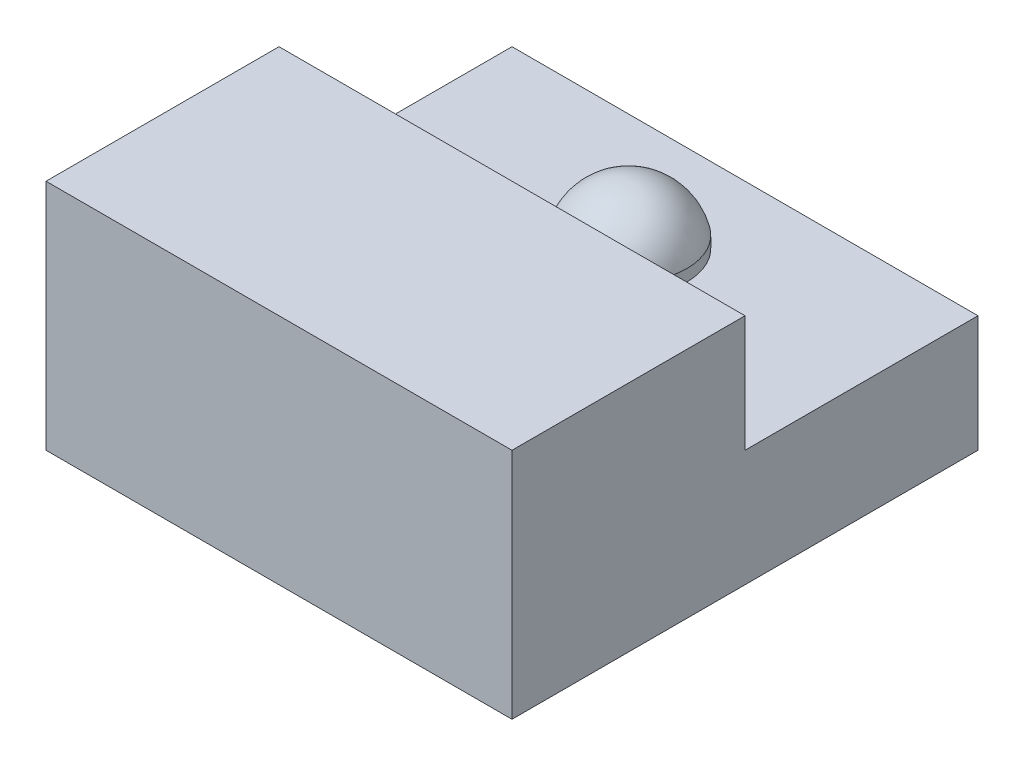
ISO-10303-21;
HEADER;
FILE_DESCRIPTION(('STEP AP214'),'2;1');
FILE_NAME('part.step','',(''),(''),'','','');
FILE_SCHEMA(('AUTOMOTIVE_DESIGN { 1 0 10303 214 1 1 1 1 }'));
ENDSEC;
DATA;
#1=APPLICATION_CONTEXT('core data for automotive mechanical design processes');
#2=APPLICATION_PROTOCOL_DEFINITION('international standard','automotive_design',2000,#1);
#3=PRODUCT_CONTEXT('',#1,'mechanical');
#4=PRODUCT('Part','Part','',(#3));
#5=PRODUCT_RELATED_PRODUCT_CATEGORY('part','',(#4));
#6=PRODUCT_DEFINITION_FORMATION('','',#4);
#7=PRODUCT_DEFINITION_CONTEXT('part definition',#1,'design');
#8=PRODUCT_DEFINITION('design','',#6,#7);
#9=PRODUCT_DEFINITION_SHAPE('','',#8);
#10=(LENGTH_UNIT() NAMED_UNIT(*) SI_UNIT(.MILLI.,.METRE.));
#11=(NAMED_UNIT(*) PLANE_ANGLE_UNIT() SI_UNIT($,.RADIAN.));
#12=(NAMED_UNIT(*) SI_UNIT($,.STERADIAN.) SOLID_ANGLE_UNIT());
#13=UNCERTAINTY_MEASURE_WITH_UNIT(LENGTH_MEASURE(1.E-05),#10,'distance_accuracy_value','');
#14=(GEOMETRIC_REPRESENTATION_CONTEXT(3) GLOBAL_UNCERTAINTY_ASSIGNED_CONTEXT((#13)) GLOBAL_UNIT_ASSIGNED_CONTEXT((#10,
#11,#12)) REPRESENTATION_CONTEXT('',''));
#15=CARTESIAN_POINT('',(0.,0.,0.));
#16=DIRECTION('',(0.,0.,1.));
#17=DIRECTION('',(1.,0.,0.));
#18=AXIS2_PLACEMENT_3D('',#15,#16,#17);
#19=CARTESIAN_POINT('',(-2.00000000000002,0.499999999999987,2.));
#20=DIRECTION('',(0.,-0.999999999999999,0.));
#21=DIRECTION('',(0.,0.,-1.));
#22=AXIS2_PLACEMENT_3D('',#19,#20,#21);
#23=PLANE('',#22);
#24=DIRECTION('',(-1.,0.,0.));
#25=VECTOR('',#24,1.);
#26=CARTESIAN_POINT('',(-2.,0.499999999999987,0.));
#27=LINE('',#26,#25);
#28=CARTESIAN_POINT('',(2.,0.499999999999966,0.));
#29=VERTEX_POINT('',#28);
#30=CARTESIAN_POINT('',(-2.,0.499999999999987,0.));
#31=VERTEX_POINT('',#30);
#32=EDGE_CURVE('E46',#29,#31,#27,.T.);
#33=ORIENTED_EDGE('',*,*,#32,.F.);
#34=DIRECTION('',(0.,0.,-1.));
#35=VECTOR('',#34,1.);
#36=CARTESIAN_POINT('',(1.99999999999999,0.499999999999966,2.));
#37=LINE('',#36,#35);
#38=CARTESIAN_POINT('',(2.,0.5,-2.));
#39=VERTEX_POINT('',#38);
#40=EDGE_CURVE('E90',#29,#39,#37,.T.);
#41=ORIENTED_EDGE('',*,*,#40,.T.);
#42=DIRECTION('',(-1.,0.,0.));
#43=VECTOR('',#42,1.);
#44=CARTESIAN_POINT('',(-2.,0.499999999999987,-2.));
#45=LINE('',#44,#43);
#46=CARTESIAN_POINT('',(-2.,0.499999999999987,-2.));
#47=VERTEX_POINT('',#46);
#48=EDGE_CURVE('E85',#39,#47,#45,.T.);
#49=ORIENTED_EDGE('',*,*,#48,.T.);
#50=DIRECTION('',(0.,0.,-1.));
#51=VECTOR('',#50,1.);
#52=CARTESIAN_POINT('',(-2.00000000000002,0.499999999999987,2.));
#53=LINE('',#52,#51);
#54=EDGE_CURVE('E82',#31,#47,#53,.T.);
#55=ORIENTED_EDGE('',*,*,#54,.F.);
#56=EDGE_LOOP('',(#33,#41,#49,#55));
#57=FACE_BOUND('',#56,.T.);
#58=CARTESIAN_POINT('',(0.,0.5,-1.));
#59=DIRECTION('',(0.,-0.999999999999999,0.));
#60=DIRECTION('',(0.,0.,-1.));
#61=AXIS2_PLACEMENT_3D('',#58,#59,#60);
#62=CIRCLE('',#61,0.5);
#63=CARTESIAN_POINT('',(0.,0.500000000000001,-1.5));
#64=VERTEX_POINT('',#63);
#65=EDGE_CURVE('E11',#64,#64,#62,.F.);
#66=ORIENTED_EDGE('',*,*,#65,.F.);
#67=EDGE_LOOP('',(#66));
#68=FACE_BOUND('',#67,.T.);
#69=ADVANCED_FACE('F31',(#57,#68),#23,.F.);
#70=CARTESIAN_POINT('',(-2.00000000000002,0.499999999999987,2.));
#71=DIRECTION('',(1.,0.,0.));
#72=DIRECTION('',(0.,0.,-1.));
#73=AXIS2_PLACEMENT_3D('',#70,#71,#72);
#74=PLANE('',#73);
#75=DIRECTION('',(0.,-0.999999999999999,0.));
#76=VECTOR('',#75,1.);
#77=CARTESIAN_POINT('',(-2.,0.499999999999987,-2.));
#78=LINE('',#77,#76);
#79=CARTESIAN_POINT('',(-2.,-0.500000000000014,-2.));
#80=VERTEX_POINT('',#79);
#81=EDGE_CURVE('E109',#47,#80,#78,.T.);
#82=ORIENTED_EDGE('',*,*,#81,.T.);
#83=DIRECTION('',(0.,0.,-1.));
#84=VECTOR('',#83,1.);
#85=CARTESIAN_POINT('',(-2.00000000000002,-0.500000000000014,2.));
#86=LINE('',#85,#84);
#87=CARTESIAN_POINT('',(-2.00000000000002,-0.500000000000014,2.));
#88=VERTEX_POINT('',#87);
#89=EDGE_CURVE('E39',#88,#80,#86,.T.);
#90=ORIENTED_EDGE('',*,*,#89,.F.);
#91=DIRECTION('',(0.,-0.999999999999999,0.));
#92=VECTOR('',#91,1.);
#93=CARTESIAN_POINT('',(-2.00000000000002,0.499999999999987,2.));
#94=LINE('',#93,#92);
#95=CARTESIAN_POINT('',(-2.00000000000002,1.49999999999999,2.));
#96=VERTEX_POINT('',#95);
#97=EDGE_CURVE('E134',#96,#88,#94,.T.);
#98=ORIENTED_EDGE('',*,*,#97,.F.);
#99=DIRECTION('',(0.,0.,1.));
#100=VECTOR('',#99,1.);
#101=CARTESIAN_POINT('',(-2.00000000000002,1.49999999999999,2.));
#102=LINE('',#101,#100);
#103=CARTESIAN_POINT('',(-2.,1.49999999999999,0.));
#104=VERTEX_POINT('',#103);
#105=EDGE_CURVE('E102',#104,#96,#102,.T.);
#106=ORIENTED_EDGE('',*,*,#105,.F.);
#107=DIRECTION('',(0.,-0.999999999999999,0.));
#108=VECTOR('',#107,1.);
#109=CARTESIAN_POINT('',(-2.,1.49999999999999,0.));
#110=LINE('',#109,#108);
#111=EDGE_CURVE('E98',#104,#31,#110,.T.);
#112=ORIENTED_EDGE('',*,*,#111,.T.);
#113=ORIENTED_EDGE('',*,*,#54,.T.);
#114=EDGE_LOOP('',(#82,#90,#98,#106,#112,#113));
#115=FACE_BOUND('',#114,.T.);
#116=ADVANCED_FACE('F105',(#115),#74,.F.);
#117=CARTESIAN_POINT('',(-2.00000000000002,-0.500000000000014,2.));
#118=DIRECTION('',(0.,0.999999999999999,0.));
#119=DIRECTION('',(0.,0.,1.));
#120=AXIS2_PLACEMENT_3D('',#117,#118,#119);
#121=PLANE('',#120);
#122=DIRECTION('',(1.,0.,0.));
#123=VECTOR('',#122,1.);
#124=CARTESIAN_POINT('',(-2.,-0.500000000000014,-2.));
#125=LINE('',#124,#123);
#126=CARTESIAN_POINT('',(2.,-0.5,-2.));
#127=VERTEX_POINT('',#126);
#128=EDGE_CURVE('E128',#80,#127,#125,.T.);
#129=ORIENTED_EDGE('',*,*,#128,.T.);
#130=DIRECTION('',(0.,0.,-1.));
#131=VECTOR('',#130,1.);
#132=CARTESIAN_POINT('',(1.99999999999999,-0.500000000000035,2.));
#133=LINE('',#132,#131);
#134=CARTESIAN_POINT('',(1.99999999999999,-0.500000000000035,2.));
#135=VERTEX_POINT('',#134);
#136=EDGE_CURVE('E143',#135,#127,#133,.T.);
#137=ORIENTED_EDGE('',*,*,#136,.F.);
#138=DIRECTION('',(1.,0.,0.));
#139=VECTOR('',#138,1.);
#140=CARTESIAN_POINT('',(-2.00000000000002,-0.500000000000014,2.));
#141=LINE('',#140,#139);
#142=EDGE_CURVE('E54',#88,#135,#141,.T.);
#143=ORIENTED_EDGE('',*,*,#142,.F.);
#144=ORIENTED_EDGE('',*,*,#89,.T.);
#145=EDGE_LOOP('',(#129,#137,#143,#144));
#146=FACE_BOUND('',#145,.T.);
#147=ADVANCED_FACE('F154',(#146),#121,.F.);
#148=CARTESIAN_POINT('',(1.99999999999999,0.499999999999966,2.));
#149=DIRECTION('',(-1.,0.,0.));
#150=DIRECTION('',(0.,0.,1.));
#151=AXIS2_PLACEMENT_3D('',#148,#149,#150);
#152=PLANE('',#151);
#153=DIRECTION('',(0.,0.999999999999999,0.));
#154=VECTOR('',#153,1.);
#155=CARTESIAN_POINT('',(2.,0.5,-2.));
#156=LINE('',#155,#154);
#157=EDGE_CURVE('E130',#127,#39,#156,.T.);
#158=ORIENTED_EDGE('',*,*,#157,.T.);
#159=ORIENTED_EDGE('',*,*,#40,.F.);
#160=DIRECTION('',(0.,-0.999999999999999,0.));
#161=VECTOR('',#160,1.);
#162=CARTESIAN_POINT('',(2.,1.49999999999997,0.));
#163=LINE('',#162,#161);
#164=CARTESIAN_POINT('',(2.,1.49999999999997,0.));
#165=VERTEX_POINT('',#164);
#166=EDGE_CURVE('E101',#165,#29,#163,.T.);
#167=ORIENTED_EDGE('',*,*,#166,.F.);
#168=DIRECTION('',(0.,0.,-1.));
#169=VECTOR('',#168,1.);
#170=CARTESIAN_POINT('',(2.,1.49999999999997,1.99999999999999));
#171=LINE('',#170,#169);
#172=CARTESIAN_POINT('',(2.,1.49999999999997,1.99999999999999));
#173=VERTEX_POINT('',#172);
#174=EDGE_CURVE('E111',#173,#165,#171,.T.);
#175=ORIENTED_EDGE('',*,*,#174,.F.);
#176=DIRECTION('',(0.,0.999999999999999,0.));
#177=VECTOR('',#176,1.);
#178=CARTESIAN_POINT('',(1.99999999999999,0.499999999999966,2.));
#179=LINE('',#178,#177);
#180=EDGE_CURVE('E91',#135,#173,#179,.T.);
#181=ORIENTED_EDGE('',*,*,#180,.F.);
#182=ORIENTED_EDGE('',*,*,#136,.T.);
#183=EDGE_LOOP('',(#158,#159,#167,#175,#181,#182));
#184=FACE_BOUND('',#183,.T.);
#185=ADVANCED_FACE('F148',(#184),#152,.F.);
#186=CARTESIAN_POINT('',(-2.00000000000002,-0.500000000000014,2.));
#187=DIRECTION('',(0.,0.,1.));
#188=DIRECTION('',(1.,0.,0.));
#189=AXIS2_PLACEMENT_3D('',#186,#187,#188);
#190=PLANE('',#189);
#191=ORIENTED_EDGE('',*,*,#97,.T.);
#192=ORIENTED_EDGE('',*,*,#142,.T.);
#193=ORIENTED_EDGE('',*,*,#180,.T.);
#194=DIRECTION('',(1.,0.,0.));
#195=VECTOR('',#194,1.);
#196=CARTESIAN_POINT('',(-2.00000000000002,1.49999999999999,2.));
#197=LINE('',#196,#195);
#198=EDGE_CURVE('E123',#96,#173,#197,.T.);
#199=ORIENTED_EDGE('',*,*,#198,.F.);
#200=EDGE_LOOP('',(#191,#192,#193,#199));
#201=FACE_BOUND('',#200,.T.);
#202=ADVANCED_FACE('F155',(#201),#190,.T.);
#203=CARTESIAN_POINT('',(-2.,-0.500000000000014,-2.));
#204=DIRECTION('',(0.,0.,1.));
#205=DIRECTION('',(1.,0.,0.));
#206=AXIS2_PLACEMENT_3D('',#203,#204,#205);
#207=PLANE('',#206);
#208=ORIENTED_EDGE('',*,*,#81,.F.);
#209=ORIENTED_EDGE('',*,*,#48,.F.);
#210=ORIENTED_EDGE('',*,*,#157,.F.);
#211=ORIENTED_EDGE('',*,*,#128,.F.);
#212=EDGE_LOOP('',(#208,#209,#210,#211));
#213=FACE_BOUND('',#212,.T.);
#214=ADVANCED_FACE('F150',(#213),#207,.F.);
#215=CARTESIAN_POINT('',(-2.,1.49999999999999,0.));
#216=DIRECTION('',(0.,0.,1.));
#217=DIRECTION('',(1.,0.,0.));
#218=AXIS2_PLACEMENT_3D('',#215,#216,#217);
#219=PLANE('',#218);
#220=ORIENTED_EDGE('',*,*,#32,.T.);
#221=ORIENTED_EDGE('',*,*,#111,.F.);
#222=DIRECTION('',(-1.,0.,0.));
#223=VECTOR('',#222,1.);
#224=CARTESIAN_POINT('',(-2.,1.49999999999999,0.));
#225=LINE('',#224,#223);
#226=EDGE_CURVE('E107',#165,#104,#225,.T.);
#227=ORIENTED_EDGE('',*,*,#226,.F.);
#228=ORIENTED_EDGE('',*,*,#166,.T.);
#229=EDGE_LOOP('',(#220,#221,#227,#228));
#230=FACE_BOUND('',#229,.T.);
#231=ADVANCED_FACE('F96',(#230),#219,.F.);
#232=CARTESIAN_POINT('',(-2.00000000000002,1.49999999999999,2.));
#233=DIRECTION('',(0.,-0.999999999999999,0.));
#234=DIRECTION('',(0.,0.,-1.));
#235=AXIS2_PLACEMENT_3D('',#232,#233,#234);
#236=PLANE('',#235);
#237=ORIENTED_EDGE('',*,*,#105,.T.);
#238=ORIENTED_EDGE('',*,*,#198,.T.);
#239=ORIENTED_EDGE('',*,*,#174,.T.);
#240=ORIENTED_EDGE('',*,*,#226,.T.);
#241=EDGE_LOOP('',(#237,#238,#239,#240));
#242=FACE_BOUND('',#241,.T.);
#243=ADVANCED_FACE('F158',(#242),#236,.F.);
#244=CARTESIAN_POINT('',(0.,0.599999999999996,-1.));
#245=DIRECTION('',(0.,-0.999999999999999,0.));
#246=DIRECTION('',(0.,0.,-1.));
#247=AXIS2_PLACEMENT_3D('',#244,#245,#246);
#248=CYLINDRICAL_SURFACE('',#247,0.5);
#249=CARTESIAN_POINT('',(0.,0.599999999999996,-1.));
#250=DIRECTION('',(0.,0.999999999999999,0.));
#251=DIRECTION('',(0.,0.,1.));
#252=AXIS2_PLACEMENT_3D('',#249,#250,#251);
#253=CIRCLE('',#252,0.5);
#254=CARTESIAN_POINT('',(0.,0.599999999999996,-1.5));
#255=VERTEX_POINT('',#254);
#256=EDGE_CURVE('E103',#255,#255,#253,.T.);
#257=CARTESIAN_POINT('',(0.,0.599999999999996,-1.5));
#258=CARTESIAN_POINT('',(0.,0.59895833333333,-1.5));
#259=CARTESIAN_POINT('',(0.,0.597916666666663,-1.5));
#260=CARTESIAN_POINT('',(0.,0.59583333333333,-1.5));
#261=CARTESIAN_POINT('',(0.,0.594791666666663,-1.5));
#262=CARTESIAN_POINT('',(0.,0.59270833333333,-1.5));
#263=CARTESIAN_POINT('',(0.,0.591666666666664,-1.5));
#264=CARTESIAN_POINT('',(0.,0.58958333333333,-1.5));
#265=CARTESIAN_POINT('',(0.,0.588541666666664,-1.5));
#266=CARTESIAN_POINT('',(0.,0.58645833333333,-1.5));
#267=CARTESIAN_POINT('',(0.,0.585416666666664,-1.5));
#268=CARTESIAN_POINT('',(0.,0.58333333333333,-1.5));
#269=CARTESIAN_POINT('',(0.,0.582291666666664,-1.5));
#270=CARTESIAN_POINT('',(0.,0.580208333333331,-1.5));
#271=CARTESIAN_POINT('',(0.,0.579166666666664,-1.5));
#272=CARTESIAN_POINT('',(0.,0.577083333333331,-1.5));
#273=CARTESIAN_POINT('',(0.,0.576041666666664,-1.5));
#274=CARTESIAN_POINT('',(0.,0.573958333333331,-1.5));
#275=CARTESIAN_POINT('',(0.,0.572916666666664,-1.5));
#276=CARTESIAN_POINT('',(0.,0.570833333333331,-1.5));
#277=CARTESIAN_POINT('',(0.,0.569791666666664,-1.5));
#278=CARTESIAN_POINT('',(0.,0.567708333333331,-1.5));
#279=CARTESIAN_POINT('',(0.,0.566666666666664,-1.5));
#280=CARTESIAN_POINT('',(0.,0.564583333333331,-1.5));
#281=CARTESIAN_POINT('',(0.,0.563541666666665,-1.5));
#282=CARTESIAN_POINT('',(0.,0.561458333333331,-1.5));
#283=CARTESIAN_POINT('',(0.,0.560416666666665,-1.5));
#284=CARTESIAN_POINT('',(0.,0.558333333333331,-1.5));
#285=CARTESIAN_POINT('',(0.,0.557291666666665,-1.5));
#286=CARTESIAN_POINT('',(0.,0.555208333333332,-1.5));
#287=CARTESIAN_POINT('',(0.,0.554166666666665,-1.5));
#288=CARTESIAN_POINT('',(0.,0.552083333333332,-1.5));
#289=CARTESIAN_POINT('',(0.,0.551041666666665,-1.5));
#290=CARTESIAN_POINT('',(0.,0.548958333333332,-1.5));
#291=CARTESIAN_POINT('',(0.,0.547916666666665,-1.5));
#292=CARTESIAN_POINT('',(0.,0.545833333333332,-1.5));
#293=CARTESIAN_POINT('',(0.,0.544791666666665,-1.5));
#294=CARTESIAN_POINT('',(0.,0.542708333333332,-1.5));
#295=CARTESIAN_POINT('',(0.,0.541666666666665,-1.5));
#296=CARTESIAN_POINT('',(0.,0.539583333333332,-1.5));
#297=CARTESIAN_POINT('',(0.,0.538541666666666,-1.5));
#298=CARTESIAN_POINT('',(0.,0.536458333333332,-1.5));
#299=CARTESIAN_POINT('',(0.,0.535416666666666,-1.5));
#300=CARTESIAN_POINT('',(0.,0.533333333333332,-1.5));
#301=CARTESIAN_POINT('',(0.,0.532291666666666,-1.5));
#302=CARTESIAN_POINT('',(0.,0.530208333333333,-1.5));
#303=CARTESIAN_POINT('',(0.,0.529166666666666,-1.5));
#304=CARTESIAN_POINT('',(0.,0.527083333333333,-1.5));
#305=CARTESIAN_POINT('',(0.,0.526041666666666,-1.5));
#306=CARTESIAN_POINT('',(0.,0.523958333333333,-1.5));
#307=CARTESIAN_POINT('',(0.,0.522916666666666,-1.5));
#308=CARTESIAN_POINT('',(0.,0.520833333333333,-1.5));
#309=CARTESIAN_POINT('',(0.,0.519791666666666,-1.5));
#310=CARTESIAN_POINT('',(0.,0.517708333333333,-1.5));
#311=CARTESIAN_POINT('',(0.,0.516666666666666,-1.5));
#312=CARTESIAN_POINT('',(0.,0.514583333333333,-1.5));
#313=CARTESIAN_POINT('',(0.,0.513541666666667,-1.5));
#314=CARTESIAN_POINT('',(0.,0.511458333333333,-1.5));
#315=CARTESIAN_POINT('',(0.,0.510416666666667,-1.5));
#316=CARTESIAN_POINT('',(0.,0.508333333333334,-1.5));
#317=CARTESIAN_POINT('',(0.,0.507291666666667,-1.5));
#318=CARTESIAN_POINT('',(0.,0.505208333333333,-1.5));
#319=CARTESIAN_POINT('',(0.,0.504166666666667,-1.5));
#320=CARTESIAN_POINT('',(0.,0.502083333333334,-1.5));
#321=CARTESIAN_POINT('',(0.,0.501041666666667,-1.5));
#322=CARTESIAN_POINT('',(0.,0.500000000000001,-1.5));
#323=B_SPLINE_CURVE_WITH_KNOTS('',3,(#257,#258,#259,#260,#261,#262,#263,#264,#265,#266,#267,
#268,#269,#270,#271,#272,#273,#274,#275,#276,#277,#278,#279,#280,#281,#282,#283,#284,#285,#286,
#287,#288,#289,#290,#291,#292,#293,#294,#295,#296,#297,#298,#299,#300,#301,#302,#303,#304,#305,
#306,#307,#308,#309,#310,#311,#312,#313,#314,#315,#316,#317,#318,#319,#320,#321,#322),
.UNSPECIFIED.,.F.,.F.,(4,2,2,2,2,2,2,2,2,2,2,2,2,2,2,2,2,2,2,2,2,2,2,2,2,2,2,2,2,2,2,2,4),(0.,
0.00312499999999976,0.00624999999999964,0.00937499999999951,0.0124999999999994,
0.0156249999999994,0.0187499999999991,0.021874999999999,0.0249999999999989,0.0281249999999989,
0.0312499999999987,0.0343749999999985,0.0374999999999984,0.0406249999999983,0.0437499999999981,
0.0468749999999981,0.0499999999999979,0.0531249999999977,0.0562499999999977,0.0593749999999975,
0.0624999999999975,0.0656249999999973,0.0687499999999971,0.071874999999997,0.0749999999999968,
0.0781249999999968,0.0812499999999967,0.0843749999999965,0.0874999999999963,0.0906249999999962,
0.0937499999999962,0.096874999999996,0.0999999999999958),.UNSPECIFIED.);
#324=EDGE_CURVE('BSEAM160',#255,#64,#323,.T.);
#325=ORIENTED_EDGE('',*,*,#256,.F.);
#326=ORIENTED_EDGE('',*,*,#65,.T.);
#327=ORIENTED_EDGE('',*,*,#324,.T.);
#328=ORIENTED_EDGE('',*,*,#324,.F.);
#329=EDGE_LOOP('',(#325,#327,#326,#328));
#330=FACE_BOUND('',#329,.T.);
#331=ADVANCED_FACE('F160',(#330),#248,.T.);
#332=CARTESIAN_POINT('',(0.,0.487500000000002,-1.));
#333=DIRECTION('',(0.,0.,1.));
#334=DIRECTION('',(1.,0.,0.));
#335=AXIS2_PLACEMENT_3D('',#332,#333,#334);
#336=SPHERICAL_SURFACE('',#335,0.5125);
#337=CARTESIAN_POINT('',(0.,0.487500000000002,-1.));
#338=DIRECTION('',(0.,1.,0.));
#339=DIRECTION('',(0.,0.,1.));
#340=AXIS2_PLACEMENT_3D('',#337,#338,#339);
#341=SPHERICAL_SURFACE('',#340,0.5125);
#342=ORIENTED_EDGE('',*,*,#256,.T.);
#343=EDGE_LOOP('',(#342));
#344=FACE_BOUND('',#343,.T.);
#345=ADVANCED_FACE('F33',(#344),#341,.T.);
#346=CLOSED_SHELL('',(#69,#116,#147,#185,#202,#214,#231,#243,#331,#345));
#347=MANIFOLD_SOLID_BREP('B2',#346);
#348=ADVANCED_BREP_SHAPE_REPRESENTATION('',(#18,#347),#14);
#349=SHAPE_DEFINITION_REPRESENTATION(#9,#348);
ENDSEC;
END-ISO-10303-21;
